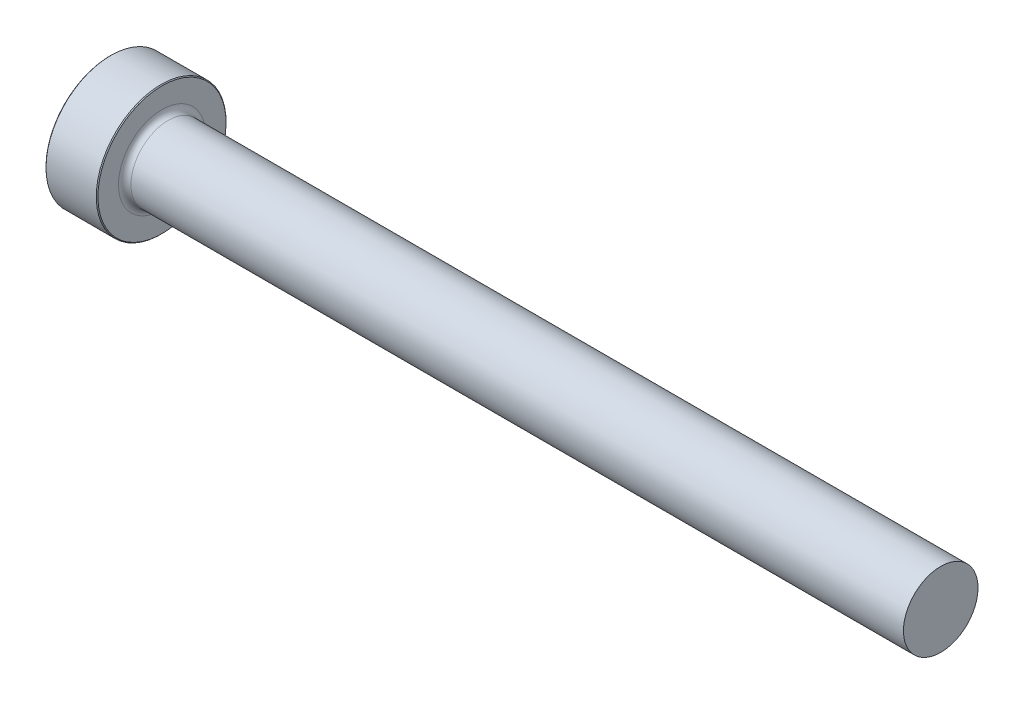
from build123d import *

# Parameters (mm, degrees)
CHAMFER1_SIZE = 0.1016


with BuildPart() as part:
    # Sketch1 → Revolve1 (revolve)
    with BuildSketch(Plane.XY):
        with BuildLine():
            Line((0, 0), (0, 7.9375))
            Line((0, 7.9375), (6.35, 7.9375))
            Line((6.35, 7.9375), (6.35, 5.3222525))
            ThreePointArc((6.35, 5.3222525), (6.573184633, 4.783437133), (7.112, 4.5602525))
            Line((7.112, 4.5602525), (101.6, 4.5602525))
            Line((101.6, 4.5602525), (101.6, 0))
            Line((101.6, 0), (0, 0))
        make_face()
    revolve(axis=Axis((101.6, 0, 0), (-1, 0, 0)))

    # Chamfer1
    chamfer1_edges = [part.edges().sort_by_distance(p)[0] for p in [
        (0, -7.9375, 0),
        (6.35, -7.9375, 0),
    ]]
    chamfer(chamfer1_edges, length=CHAMFER1_SIZE)


solid = part.part
